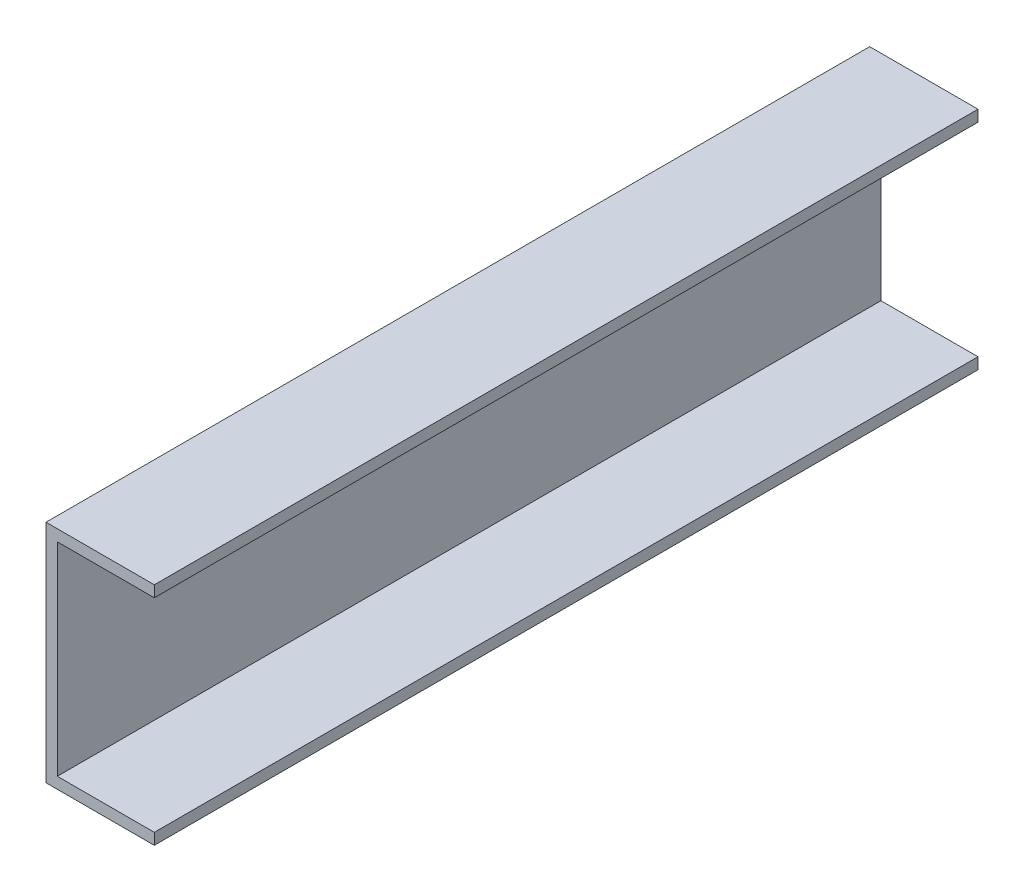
ISO-10303-21;
HEADER;
FILE_DESCRIPTION(('STEP AP214'),'2;1');
FILE_NAME('part.step','',(''),(''),'','','');
FILE_SCHEMA(('AUTOMOTIVE_DESIGN { 1 0 10303 214 1 1 1 1 }'));
ENDSEC;
DATA;
#1=APPLICATION_CONTEXT('core data for automotive mechanical design processes');
#2=APPLICATION_PROTOCOL_DEFINITION('international standard','automotive_design',2000,#1);
#3=PRODUCT_CONTEXT('',#1,'mechanical');
#4=PRODUCT('Part','Part','',(#3));
#5=PRODUCT_RELATED_PRODUCT_CATEGORY('part','',(#4));
#6=PRODUCT_DEFINITION_FORMATION('','',#4);
#7=PRODUCT_DEFINITION_CONTEXT('part definition',#1,'design');
#8=PRODUCT_DEFINITION('design','',#6,#7);
#9=PRODUCT_DEFINITION_SHAPE('','',#8);
#10=(LENGTH_UNIT() NAMED_UNIT(*) SI_UNIT(.MILLI.,.METRE.));
#11=(NAMED_UNIT(*) PLANE_ANGLE_UNIT() SI_UNIT($,.RADIAN.));
#12=(NAMED_UNIT(*) SI_UNIT($,.STERADIAN.) SOLID_ANGLE_UNIT());
#13=UNCERTAINTY_MEASURE_WITH_UNIT(LENGTH_MEASURE(1.E-05),#10,'distance_accuracy_value','');
#14=(GEOMETRIC_REPRESENTATION_CONTEXT(3) GLOBAL_UNCERTAINTY_ASSIGNED_CONTEXT((#13)) GLOBAL_UNIT_ASSIGNED_CONTEXT((#10,
#11,#12)) REPRESENTATION_CONTEXT('',''));
#15=CARTESIAN_POINT('',(0.,0.,0.));
#16=DIRECTION('',(0.,0.,1.));
#17=DIRECTION('',(1.,0.,0.));
#18=AXIS2_PLACEMENT_3D('',#15,#16,#17);
#19=CARTESIAN_POINT('',(48.,5.,182.5));
#20=DIRECTION('',(-1.,0.,0.));
#21=DIRECTION('',(0.,0.,1.));
#22=AXIS2_PLACEMENT_3D('',#19,#20,#21);
#23=PLANE('',#22);
#24=DIRECTION('',(0.,1.,0.));
#25=VECTOR('',#24,1.);
#26=CARTESIAN_POINT('',(48.,5.,-182.5));
#27=LINE('',#26,#25);
#28=CARTESIAN_POINT('',(48.,0.,-182.5));
#29=VERTEX_POINT('',#28);
#30=CARTESIAN_POINT('',(48.,5.,-182.5));
#31=VERTEX_POINT('',#30);
#32=EDGE_CURVE('E131',#29,#31,#27,.T.);
#33=ORIENTED_EDGE('',*,*,#32,.T.);
#34=DIRECTION('',(0.,0.,-1.));
#35=VECTOR('',#34,1.);
#36=CARTESIAN_POINT('',(48.,5.,182.5));
#37=LINE('',#36,#35);
#38=CARTESIAN_POINT('',(48.,5.,182.5));
#39=VERTEX_POINT('',#38);
#40=EDGE_CURVE('E11',#39,#31,#37,.T.);
#41=ORIENTED_EDGE('',*,*,#40,.F.);
#42=DIRECTION('',(0.,1.,0.));
#43=VECTOR('',#42,1.);
#44=CARTESIAN_POINT('',(48.,5.,182.5));
#45=LINE('',#44,#43);
#46=CARTESIAN_POINT('',(48.,0.,182.5));
#47=VERTEX_POINT('',#46);
#48=EDGE_CURVE('E145',#47,#39,#45,.T.);
#49=ORIENTED_EDGE('',*,*,#48,.F.);
#50=DIRECTION('',(0.,0.,-1.));
#51=VECTOR('',#50,1.);
#52=CARTESIAN_POINT('',(48.,0.,182.5));
#53=LINE('',#52,#51);
#54=EDGE_CURVE('E127',#47,#29,#53,.T.);
#55=ORIENTED_EDGE('',*,*,#54,.T.);
#56=EDGE_LOOP('',(#33,#41,#49,#55));
#57=FACE_BOUND('',#56,.T.);
#58=ADVANCED_FACE('F35',(#57),#23,.F.);
#59=CARTESIAN_POINT('',(5.00000000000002,5.,182.5));
#60=DIRECTION('',(0.,-1.,0.));
#61=DIRECTION('',(0.,0.,-1.));
#62=AXIS2_PLACEMENT_3D('',#59,#60,#61);
#63=PLANE('',#62);
#64=DIRECTION('',(-1.,0.,0.));
#65=VECTOR('',#64,1.);
#66=CARTESIAN_POINT('',(5.00000000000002,5.,-182.5));
#67=LINE('',#66,#65);
#68=CARTESIAN_POINT('',(5.00000000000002,5.,-182.5));
#69=VERTEX_POINT('',#68);
#70=EDGE_CURVE('E134',#31,#69,#67,.T.);
#71=ORIENTED_EDGE('',*,*,#70,.T.);
#72=DIRECTION('',(0.,0.,-1.));
#73=VECTOR('',#72,1.);
#74=CARTESIAN_POINT('',(5.00000000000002,5.,182.5));
#75=LINE('',#74,#73);
#76=CARTESIAN_POINT('',(5.00000000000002,5.,182.5));
#77=VERTEX_POINT('',#76);
#78=EDGE_CURVE('E43',#77,#69,#75,.T.);
#79=ORIENTED_EDGE('',*,*,#78,.F.);
#80=DIRECTION('',(-1.,0.,0.));
#81=VECTOR('',#80,1.);
#82=CARTESIAN_POINT('',(5.00000000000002,5.,182.5));
#83=LINE('',#82,#81);
#84=EDGE_CURVE('E94',#39,#77,#83,.T.);
#85=ORIENTED_EDGE('',*,*,#84,.F.);
#86=ORIENTED_EDGE('',*,*,#40,.T.);
#87=EDGE_LOOP('',(#71,#79,#85,#86));
#88=FACE_BOUND('',#87,.T.);
#89=ADVANCED_FACE('F180',(#88),#63,.F.);
#90=CARTESIAN_POINT('',(5.00000000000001,95.,182.5));
#91=DIRECTION('',(-1.,0.,0.));
#92=DIRECTION('',(0.,-1.,0.));
#93=AXIS2_PLACEMENT_3D('',#90,#91,#92);
#94=PLANE('',#93);
#95=DIRECTION('',(0.,1.,0.));
#96=VECTOR('',#95,1.);
#97=CARTESIAN_POINT('',(5.00000000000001,95.,-182.5));
#98=LINE('',#97,#96);
#99=CARTESIAN_POINT('',(5.00000000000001,95.,-182.5));
#100=VERTEX_POINT('',#99);
#101=EDGE_CURVE('E136',#69,#100,#98,.T.);
#102=ORIENTED_EDGE('',*,*,#101,.T.);
#103=DIRECTION('',(0.,0.,-1.));
#104=VECTOR('',#103,1.);
#105=CARTESIAN_POINT('',(5.00000000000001,95.,182.5));
#106=LINE('',#105,#104);
#107=CARTESIAN_POINT('',(5.00000000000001,95.,182.5));
#108=VERTEX_POINT('',#107);
#109=EDGE_CURVE('E152',#108,#100,#106,.T.);
#110=ORIENTED_EDGE('',*,*,#109,.F.);
#111=DIRECTION('',(0.,1.,0.));
#112=VECTOR('',#111,1.);
#113=CARTESIAN_POINT('',(5.00000000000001,95.,182.5));
#114=LINE('',#113,#112);
#115=EDGE_CURVE('E160',#77,#108,#114,.T.);
#116=ORIENTED_EDGE('',*,*,#115,.F.);
#117=ORIENTED_EDGE('',*,*,#78,.T.);
#118=EDGE_LOOP('',(#102,#110,#116,#117));
#119=FACE_BOUND('',#118,.T.);
#120=ADVANCED_FACE('F158',(#119),#94,.F.);
#121=CARTESIAN_POINT('',(48.,95.,182.5));
#122=DIRECTION('',(0.,1.,0.));
#123=DIRECTION('',(0.,0.,1.));
#124=AXIS2_PLACEMENT_3D('',#121,#122,#123);
#125=PLANE('',#124);
#126=DIRECTION('',(1.,0.,0.));
#127=VECTOR('',#126,1.);
#128=CARTESIAN_POINT('',(48.,95.,-182.5));
#129=LINE('',#128,#127);
#130=CARTESIAN_POINT('',(48.,95.,-182.5));
#131=VERTEX_POINT('',#130);
#132=EDGE_CURVE('E138',#100,#131,#129,.T.);
#133=ORIENTED_EDGE('',*,*,#132,.T.);
#134=DIRECTION('',(0.,0.,-1.));
#135=VECTOR('',#134,1.);
#136=CARTESIAN_POINT('',(48.,95.,182.5));
#137=LINE('',#136,#135);
#138=CARTESIAN_POINT('',(48.,95.,182.5));
#139=VERTEX_POINT('',#138);
#140=EDGE_CURVE('E149',#139,#131,#137,.T.);
#141=ORIENTED_EDGE('',*,*,#140,.F.);
#142=DIRECTION('',(1.,0.,0.));
#143=VECTOR('',#142,1.);
#144=CARTESIAN_POINT('',(48.,95.,182.5));
#145=LINE('',#144,#143);
#146=EDGE_CURVE('E172',#108,#139,#145,.T.);
#147=ORIENTED_EDGE('',*,*,#146,.F.);
#148=ORIENTED_EDGE('',*,*,#109,.T.);
#149=EDGE_LOOP('',(#133,#141,#147,#148));
#150=FACE_BOUND('',#149,.T.);
#151=ADVANCED_FACE('F168',(#150),#125,.F.);
#152=CARTESIAN_POINT('',(48.,100.,182.5));
#153=DIRECTION('',(-1.,0.,0.));
#154=DIRECTION('',(0.,-1.,0.));
#155=AXIS2_PLACEMENT_3D('',#152,#153,#154);
#156=PLANE('',#155);
#157=DIRECTION('',(0.,1.,0.));
#158=VECTOR('',#157,1.);
#159=CARTESIAN_POINT('',(48.,100.,-182.5));
#160=LINE('',#159,#158);
#161=CARTESIAN_POINT('',(48.,100.,-182.5));
#162=VERTEX_POINT('',#161);
#163=EDGE_CURVE('E140',#131,#162,#160,.T.);
#164=ORIENTED_EDGE('',*,*,#163,.T.);
#165=DIRECTION('',(0.,0.,-1.));
#166=VECTOR('',#165,1.);
#167=CARTESIAN_POINT('',(48.,100.,182.5));
#168=LINE('',#167,#166);
#169=CARTESIAN_POINT('',(48.,100.,182.5));
#170=VERTEX_POINT('',#169);
#171=EDGE_CURVE('E122',#170,#162,#168,.T.);
#172=ORIENTED_EDGE('',*,*,#171,.F.);
#173=DIRECTION('',(0.,1.,0.));
#174=VECTOR('',#173,1.);
#175=CARTESIAN_POINT('',(48.,100.,182.5));
#176=LINE('',#175,#174);
#177=EDGE_CURVE('E113',#139,#170,#176,.T.);
#178=ORIENTED_EDGE('',*,*,#177,.F.);
#179=ORIENTED_EDGE('',*,*,#140,.T.);
#180=EDGE_LOOP('',(#164,#172,#178,#179));
#181=FACE_BOUND('',#180,.T.);
#182=ADVANCED_FACE('F171',(#181),#156,.F.);
#183=CARTESIAN_POINT('',(0.,100.,182.5));
#184=DIRECTION('',(0.,-1.,0.));
#185=DIRECTION('',(0.,0.,-1.));
#186=AXIS2_PLACEMENT_3D('',#183,#184,#185);
#187=PLANE('',#186);
#188=DIRECTION('',(-1.,0.,0.));
#189=VECTOR('',#188,1.);
#190=CARTESIAN_POINT('',(0.,100.,-182.5));
#191=LINE('',#190,#189);
#192=CARTESIAN_POINT('',(0.,100.,-182.5));
#193=VERTEX_POINT('',#192);
#194=EDGE_CURVE('E121',#162,#193,#191,.T.);
#195=ORIENTED_EDGE('',*,*,#194,.T.);
#196=DIRECTION('',(0.,0.,-1.));
#197=VECTOR('',#196,1.);
#198=CARTESIAN_POINT('',(0.,100.,182.5));
#199=LINE('',#198,#197);
#200=CARTESIAN_POINT('',(0.,100.,182.5));
#201=VERTEX_POINT('',#200);
#202=EDGE_CURVE('E118',#201,#193,#199,.T.);
#203=ORIENTED_EDGE('',*,*,#202,.F.);
#204=DIRECTION('',(-1.,0.,0.));
#205=VECTOR('',#204,1.);
#206=CARTESIAN_POINT('',(0.,100.,182.5));
#207=LINE('',#206,#205);
#208=EDGE_CURVE('E107',#170,#201,#207,.T.);
#209=ORIENTED_EDGE('',*,*,#208,.F.);
#210=ORIENTED_EDGE('',*,*,#171,.T.);
#211=EDGE_LOOP('',(#195,#203,#209,#210));
#212=FACE_BOUND('',#211,.T.);
#213=ADVANCED_FACE('F119',(#212),#187,.F.);
#214=CARTESIAN_POINT('',(0.,0.,182.5));
#215=DIRECTION('',(1.,0.,0.));
#216=DIRECTION('',(0.,0.,-1.));
#217=AXIS2_PLACEMENT_3D('',#214,#215,#216);
#218=PLANE('',#217);
#219=DIRECTION('',(0.,-1.,0.));
#220=VECTOR('',#219,1.);
#221=CARTESIAN_POINT('',(0.,0.,-182.5));
#222=LINE('',#221,#220);
#223=CARTESIAN_POINT('',(0.,0.,-182.5));
#224=VERTEX_POINT('',#223);
#225=EDGE_CURVE('E80',#193,#224,#222,.T.);
#226=ORIENTED_EDGE('',*,*,#225,.T.);
#227=DIRECTION('',(0.,0.,-1.));
#228=VECTOR('',#227,1.);
#229=CARTESIAN_POINT('',(0.,0.,182.5));
#230=LINE('',#229,#228);
#231=CARTESIAN_POINT('',(0.,0.,182.5));
#232=VERTEX_POINT('',#231);
#233=EDGE_CURVE('E123',#232,#224,#230,.T.);
#234=ORIENTED_EDGE('',*,*,#233,.F.);
#235=DIRECTION('',(0.,-1.,0.));
#236=VECTOR('',#235,1.);
#237=CARTESIAN_POINT('',(0.,0.,182.5));
#238=LINE('',#237,#236);
#239=EDGE_CURVE('E111',#201,#232,#238,.T.);
#240=ORIENTED_EDGE('',*,*,#239,.F.);
#241=ORIENTED_EDGE('',*,*,#202,.T.);
#242=EDGE_LOOP('',(#226,#234,#240,#241));
#243=FACE_BOUND('',#242,.T.);
#244=ADVANCED_FACE('F125',(#243),#218,.F.);
#245=CARTESIAN_POINT('',(48.,0.,182.5));
#246=DIRECTION('',(0.,1.,0.));
#247=DIRECTION('',(-1.,0.,0.));
#248=AXIS2_PLACEMENT_3D('',#245,#246,#247);
#249=PLANE('',#248);
#250=DIRECTION('',(1.,0.,0.));
#251=VECTOR('',#250,1.);
#252=CARTESIAN_POINT('',(48.,0.,-182.5));
#253=LINE('',#252,#251);
#254=EDGE_CURVE('E86',#224,#29,#253,.T.);
#255=ORIENTED_EDGE('',*,*,#254,.T.);
#256=ORIENTED_EDGE('',*,*,#54,.F.);
#257=DIRECTION('',(1.,0.,0.));
#258=VECTOR('',#257,1.);
#259=CARTESIAN_POINT('',(48.,0.,182.5));
#260=LINE('',#259,#258);
#261=EDGE_CURVE('E51',#232,#47,#260,.T.);
#262=ORIENTED_EDGE('',*,*,#261,.F.);
#263=ORIENTED_EDGE('',*,*,#233,.T.);
#264=EDGE_LOOP('',(#255,#256,#262,#263));
#265=FACE_BOUND('',#264,.T.);
#266=ADVANCED_FACE('F196',(#265),#249,.F.);
#267=CARTESIAN_POINT('',(0.,0.,182.5));
#268=DIRECTION('',(0.,0.,-1.));
#269=DIRECTION('',(-1.,0.,0.));
#270=AXIS2_PLACEMENT_3D('',#267,#268,#269);
#271=PLANE('',#270);
#272=ORIENTED_EDGE('',*,*,#48,.T.);
#273=ORIENTED_EDGE('',*,*,#84,.T.);
#274=ORIENTED_EDGE('',*,*,#115,.T.);
#275=ORIENTED_EDGE('',*,*,#146,.T.);
#276=ORIENTED_EDGE('',*,*,#177,.T.);
#277=ORIENTED_EDGE('',*,*,#208,.T.);
#278=ORIENTED_EDGE('',*,*,#239,.T.);
#279=ORIENTED_EDGE('',*,*,#261,.T.);
#280=EDGE_LOOP('',(#272,#273,#274,#275,#276,#277,#278,#279));
#281=FACE_BOUND('',#280,.T.);
#282=ADVANCED_FACE('F109',(#281),#271,.F.);
#283=CARTESIAN_POINT('',(0.,0.,-182.5));
#284=DIRECTION('',(0.,0.,-1.));
#285=DIRECTION('',(-1.,0.,0.));
#286=AXIS2_PLACEMENT_3D('',#283,#284,#285);
#287=PLANE('',#286);
#288=ORIENTED_EDGE('',*,*,#32,.F.);
#289=ORIENTED_EDGE('',*,*,#254,.F.);
#290=ORIENTED_EDGE('',*,*,#225,.F.);
#291=ORIENTED_EDGE('',*,*,#194,.F.);
#292=ORIENTED_EDGE('',*,*,#163,.F.);
#293=ORIENTED_EDGE('',*,*,#132,.F.);
#294=ORIENTED_EDGE('',*,*,#101,.F.);
#295=ORIENTED_EDGE('',*,*,#70,.F.);
#296=EDGE_LOOP('',(#288,#289,#290,#291,#292,#293,#294,#295));
#297=FACE_BOUND('',#296,.T.);
#298=ADVANCED_FACE('F164',(#297),#287,.T.);
#299=CLOSED_SHELL('',(#58,#89,#120,#151,#182,#213,#244,#266,#282,#298));
#300=MANIFOLD_SOLID_BREP('B2',#299);
#301=ADVANCED_BREP_SHAPE_REPRESENTATION('',(#18,#300),#14);
#302=SHAPE_DEFINITION_REPRESENTATION(#9,#301);
ENDSEC;
END-ISO-10303-21;
